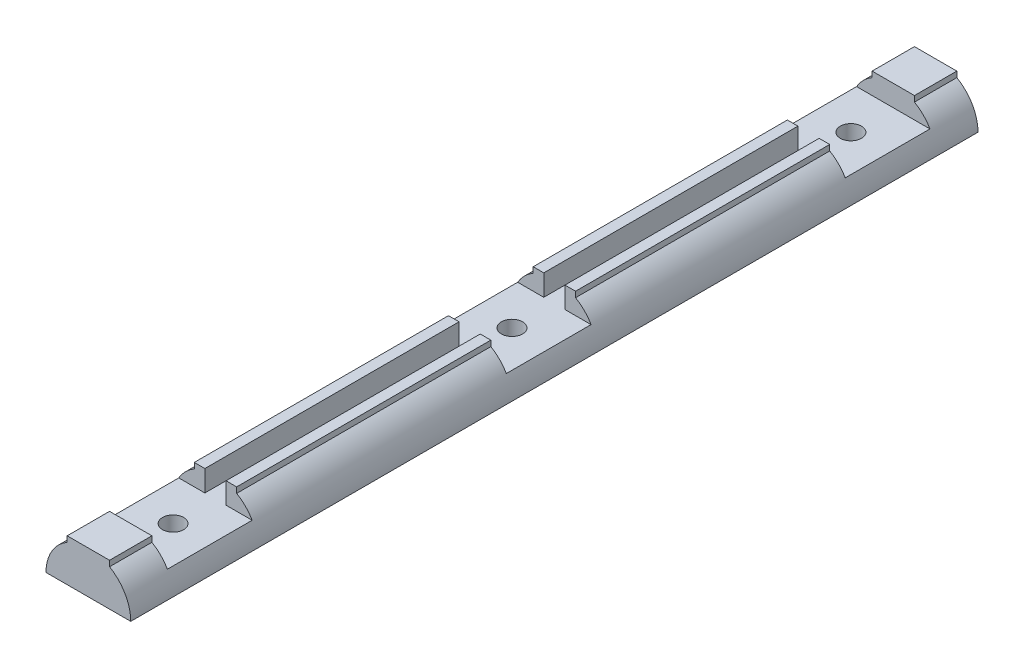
ISO-10303-21;
HEADER;
FILE_DESCRIPTION(('STEP AP214'),'2;1');
FILE_NAME('part.step','',(''),(''),'','','');
FILE_SCHEMA(('AUTOMOTIVE_DESIGN { 1 0 10303 214 1 1 1 1 }'));
ENDSEC;
DATA;
#1=APPLICATION_CONTEXT('core data for automotive mechanical design processes');
#2=APPLICATION_PROTOCOL_DEFINITION('international standard','automotive_design',2000,#1);
#3=PRODUCT_CONTEXT('',#1,'mechanical');
#4=PRODUCT('Part','Part','',(#3));
#5=PRODUCT_RELATED_PRODUCT_CATEGORY('part','',(#4));
#6=PRODUCT_DEFINITION_FORMATION('','',#4);
#7=PRODUCT_DEFINITION_CONTEXT('part definition',#1,'design');
#8=PRODUCT_DEFINITION('design','',#6,#7);
#9=PRODUCT_DEFINITION_SHAPE('','',#8);
#10=(LENGTH_UNIT() NAMED_UNIT(*) SI_UNIT(.MILLI.,.METRE.));
#11=(NAMED_UNIT(*) PLANE_ANGLE_UNIT() SI_UNIT($,.RADIAN.));
#12=(NAMED_UNIT(*) SI_UNIT($,.STERADIAN.) SOLID_ANGLE_UNIT());
#13=UNCERTAINTY_MEASURE_WITH_UNIT(LENGTH_MEASURE(1.E-05),#10,'distance_accuracy_value','');
#14=(GEOMETRIC_REPRESENTATION_CONTEXT(3) GLOBAL_UNCERTAINTY_ASSIGNED_CONTEXT((#13)) GLOBAL_UNIT_ASSIGNED_CONTEXT((#10,
#11,#12)) REPRESENTATION_CONTEXT('',''));
#15=CARTESIAN_POINT('',(0.,0.,0.));
#16=DIRECTION('',(0.,0.,1.));
#17=DIRECTION('',(1.,0.,0.));
#18=AXIS2_PLACEMENT_3D('',#15,#16,#17);
#19=CARTESIAN_POINT('',(0.,0.,100.));
#20=DIRECTION('',(0.,0.,-1.));
#21=DIRECTION('',(-1.,0.,0.));
#22=AXIS2_PLACEMENT_3D('',#19,#20,#21);
#23=CYLINDRICAL_SURFACE('',#22,10.);
#24=CARTESIAN_POINT('',(0.,0.,-100.));
#25=DIRECTION('',(0.,0.,1.));
#26=DIRECTION('',(1.,0.,0.));
#27=AXIS2_PLACEMENT_3D('',#24,#25,#26);
#28=CIRCLE('',#27,10.);
#29=CARTESIAN_POINT('',(-5.,8.66025403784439,-100.));
#30=VERTEX_POINT('',#29);
#31=CARTESIAN_POINT('',(-10.,0.,-100.));
#32=VERTEX_POINT('',#31);
#33=EDGE_CURVE('E263',#30,#32,#28,.T.);
#34=ORIENTED_EDGE('',*,*,#33,.T.);
#35=DIRECTION('',(0.,0.,1.));
#36=VECTOR('',#35,1.);
#37=CARTESIAN_POINT('',(-10.,0.,-100.));
#38=LINE('',#37,#36);
#39=CARTESIAN_POINT('',(-10.,0.,100.));
#40=VERTEX_POINT('',#39);
#41=EDGE_CURVE('E48',#32,#40,#38,.T.);
#42=ORIENTED_EDGE('',*,*,#41,.T.);
#43=CARTESIAN_POINT('',(0.,0.,100.));
#44=DIRECTION('',(0.,0.,1.));
#45=DIRECTION('',(1.,0.,0.));
#46=AXIS2_PLACEMENT_3D('',#43,#44,#45);
#47=CIRCLE('',#46,10.);
#48=CARTESIAN_POINT('',(-5.,8.66025403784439,100.));
#49=VERTEX_POINT('',#48);
#50=EDGE_CURVE('E275',#49,#40,#47,.T.);
#51=ORIENTED_EDGE('',*,*,#50,.F.);
#52=DIRECTION('',(0.,0.,-1.));
#53=VECTOR('',#52,1.);
#54=CARTESIAN_POINT('',(-5.,8.66025403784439,100.));
#55=LINE('',#54,#53);
#56=CARTESIAN_POINT('',(-5.,8.66025403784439,90.));
#57=VERTEX_POINT('',#56);
#58=EDGE_CURVE('E264',#49,#57,#55,.T.);
#59=ORIENTED_EDGE('',*,*,#58,.T.);
#60=CARTESIAN_POINT('',(0.,0.,90.));
#61=DIRECTION('',(0.,0.,1.));
#62=DIRECTION('',(1.,0.,0.));
#63=AXIS2_PLACEMENT_3D('',#60,#61,#62);
#64=CIRCLE('',#63,10.);
#65=CARTESIAN_POINT('',(-8.66025403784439,5.,90.));
#66=VERTEX_POINT('',#65);
#67=EDGE_CURVE('E436',#57,#66,#64,.T.);
#68=ORIENTED_EDGE('',*,*,#67,.T.);
#69=DIRECTION('',(0.,0.,1.));
#70=VECTOR('',#69,1.);
#71=CARTESIAN_POINT('',(-8.66025403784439,5.,70.));
#72=LINE('',#71,#70);
#73=CARTESIAN_POINT('',(-8.66025403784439,5.,70.));
#74=VERTEX_POINT('',#73);
#75=EDGE_CURVE('E424',#74,#66,#72,.T.);
#76=ORIENTED_EDGE('',*,*,#75,.F.);
#77=CARTESIAN_POINT('',(0.,0.,70.));
#78=DIRECTION('',(0.,0.,1.));
#79=DIRECTION('',(1.,0.,0.));
#80=AXIS2_PLACEMENT_3D('',#77,#78,#79);
#81=CIRCLE('',#80,10.);
#82=CARTESIAN_POINT('',(-5.,8.66025403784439,70.));
#83=VERTEX_POINT('',#82);
#84=EDGE_CURVE('E430',#83,#74,#81,.T.);
#85=ORIENTED_EDGE('',*,*,#84,.F.);
#86=CARTESIAN_POINT('',(-5.,8.66025403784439,10.));
#87=VERTEX_POINT('',#86);
#88=EDGE_CURVE('E267',#83,#87,#55,.T.);
#89=ORIENTED_EDGE('',*,*,#88,.T.);
#90=CARTESIAN_POINT('',(0.,0.,9.99999999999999));
#91=DIRECTION('',(0.,0.,1.));
#92=DIRECTION('',(1.,0.,0.));
#93=AXIS2_PLACEMENT_3D('',#90,#91,#92);
#94=CIRCLE('',#93,10.);
#95=CARTESIAN_POINT('',(-8.66025403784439,5.,10.));
#96=VERTEX_POINT('',#95);
#97=EDGE_CURVE('E458',#87,#96,#94,.T.);
#98=ORIENTED_EDGE('',*,*,#97,.T.);
#99=DIRECTION('',(0.,0.,1.));
#100=VECTOR('',#99,1.);
#101=CARTESIAN_POINT('',(-8.66025403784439,5.,-10.));
#102=LINE('',#101,#100);
#103=CARTESIAN_POINT('',(-8.66025403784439,5.,-10.));
#104=VERTEX_POINT('',#103);
#105=EDGE_CURVE('E451',#104,#96,#102,.T.);
#106=ORIENTED_EDGE('',*,*,#105,.F.);
#107=CARTESIAN_POINT('',(0.,0.,-9.99999999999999));
#108=DIRECTION('',(0.,0.,1.));
#109=DIRECTION('',(1.,0.,0.));
#110=AXIS2_PLACEMENT_3D('',#107,#108,#109);
#111=CIRCLE('',#110,10.);
#112=CARTESIAN_POINT('',(-5.,8.66025403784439,-9.99999999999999));
#113=VERTEX_POINT('',#112);
#114=EDGE_CURVE('E311',#113,#104,#111,.T.);
#115=ORIENTED_EDGE('',*,*,#114,.F.);
#116=CARTESIAN_POINT('',(-5.,8.66025403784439,-70.));
#117=VERTEX_POINT('',#116);
#118=EDGE_CURVE('E395',#113,#117,#55,.T.);
#119=ORIENTED_EDGE('',*,*,#118,.T.);
#120=CARTESIAN_POINT('',(0.,0.,-70.));
#121=DIRECTION('',(0.,0.,1.));
#122=DIRECTION('',(1.,0.,0.));
#123=AXIS2_PLACEMENT_3D('',#120,#121,#122);
#124=CIRCLE('',#123,10.);
#125=CARTESIAN_POINT('',(-8.66025403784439,5.,-70.));
#126=VERTEX_POINT('',#125);
#127=EDGE_CURVE('E357',#117,#126,#124,.T.);
#128=ORIENTED_EDGE('',*,*,#127,.T.);
#129=DIRECTION('',(0.,0.,1.));
#130=VECTOR('',#129,1.);
#131=CARTESIAN_POINT('',(-8.66025403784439,5.,-90.));
#132=LINE('',#131,#130);
#133=CARTESIAN_POINT('',(-8.66025403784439,5.,-90.));
#134=VERTEX_POINT('',#133);
#135=EDGE_CURVE('E340',#134,#126,#132,.T.);
#136=ORIENTED_EDGE('',*,*,#135,.F.);
#137=CARTESIAN_POINT('',(0.,0.,-90.));
#138=DIRECTION('',(0.,0.,1.));
#139=DIRECTION('',(1.,0.,0.));
#140=AXIS2_PLACEMENT_3D('',#137,#138,#139);
#141=CIRCLE('',#140,10.);
#142=CARTESIAN_POINT('',(-5.,8.66025403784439,-90.));
#143=VERTEX_POINT('',#142);
#144=EDGE_CURVE('E365',#143,#134,#141,.T.);
#145=ORIENTED_EDGE('',*,*,#144,.F.);
#146=EDGE_CURVE('E269',#143,#30,#55,.T.);
#147=ORIENTED_EDGE('',*,*,#146,.T.);
#148=EDGE_LOOP('',(#34,#42,#51,#59,#68,#76,#85,#89,#98,#106,#115,#119,#128,#136,#145,#147));
#149=FACE_BOUND('',#148,.T.);
#150=ADVANCED_FACE('F33',(#149),#23,.T.);
#151=CARTESIAN_POINT('',(10.,0.,100.));
#152=VERTEX_POINT('',#151);
#153=CARTESIAN_POINT('',(5.,8.66025403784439,100.));
#154=VERTEX_POINT('',#153);
#155=EDGE_CURVE('E257',#152,#154,#47,.T.);
#156=ORIENTED_EDGE('',*,*,#155,.F.);
#157=DIRECTION('',(0.,0.,1.));
#158=VECTOR('',#157,1.);
#159=CARTESIAN_POINT('',(10.,0.,-100.));
#160=LINE('',#159,#158);
#161=CARTESIAN_POINT('',(10.,0.,-100.));
#162=VERTEX_POINT('',#161);
#163=EDGE_CURVE('E242',#162,#152,#160,.T.);
#164=ORIENTED_EDGE('',*,*,#163,.F.);
#165=CARTESIAN_POINT('',(5.,8.66025403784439,-100.));
#166=VERTEX_POINT('',#165);
#167=EDGE_CURVE('E254',#162,#166,#28,.T.);
#168=ORIENTED_EDGE('',*,*,#167,.T.);
#169=DIRECTION('',(0.,0.,-1.));
#170=VECTOR('',#169,1.);
#171=CARTESIAN_POINT('',(5.,8.66025403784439,100.));
#172=LINE('',#171,#170);
#173=CARTESIAN_POINT('',(5.,8.66025403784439,-90.));
#174=VERTEX_POINT('',#173);
#175=EDGE_CURVE('E392',#166,#174,#172,.F.);
#176=ORIENTED_EDGE('',*,*,#175,.T.);
#177=CARTESIAN_POINT('',(0.,0.,-90.));
#178=DIRECTION('',(0.,0.,1.));
#179=DIRECTION('',(1.,0.,0.));
#180=AXIS2_PLACEMENT_3D('',#177,#178,#179);
#181=CIRCLE('',#180,10.);
#182=CARTESIAN_POINT('',(8.66025403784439,5.,-90.));
#183=VERTEX_POINT('',#182);
#184=EDGE_CURVE('E360',#183,#174,#181,.T.);
#185=ORIENTED_EDGE('',*,*,#184,.F.);
#186=DIRECTION('',(0.,0.,1.));
#187=VECTOR('',#186,1.);
#188=CARTESIAN_POINT('',(8.66025403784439,5.,-90.));
#189=LINE('',#188,#187);
#190=CARTESIAN_POINT('',(8.66025403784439,5.,-70.));
#191=VERTEX_POINT('',#190);
#192=EDGE_CURVE('E347',#183,#191,#189,.T.);
#193=ORIENTED_EDGE('',*,*,#192,.T.);
#194=CARTESIAN_POINT('',(0.,0.,-70.));
#195=DIRECTION('',(0.,0.,1.));
#196=DIRECTION('',(1.,0.,0.));
#197=AXIS2_PLACEMENT_3D('',#194,#195,#196);
#198=CIRCLE('',#197,10.);
#199=CARTESIAN_POINT('',(5.,8.66025403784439,-70.));
#200=VERTEX_POINT('',#199);
#201=EDGE_CURVE('E350',#191,#200,#198,.T.);
#202=ORIENTED_EDGE('',*,*,#201,.T.);
#203=CARTESIAN_POINT('',(5.,8.66025403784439,-9.99999999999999));
#204=VERTEX_POINT('',#203);
#205=EDGE_CURVE('E393',#200,#204,#172,.F.);
#206=ORIENTED_EDGE('',*,*,#205,.T.);
#207=CARTESIAN_POINT('',(0.,0.,-9.99999999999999));
#208=DIRECTION('',(0.,0.,1.));
#209=DIRECTION('',(1.,0.,0.));
#210=AXIS2_PLACEMENT_3D('',#207,#208,#209);
#211=CIRCLE('',#210,10.);
#212=CARTESIAN_POINT('',(8.66025403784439,5.,-10.));
#213=VERTEX_POINT('',#212);
#214=EDGE_CURVE('E466',#213,#204,#211,.T.);
#215=ORIENTED_EDGE('',*,*,#214,.F.);
#216=DIRECTION('',(0.,0.,1.));
#217=VECTOR('',#216,1.);
#218=CARTESIAN_POINT('',(8.66025403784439,5.,-10.));
#219=LINE('',#218,#217);
#220=CARTESIAN_POINT('',(8.66025403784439,5.,10.));
#221=VERTEX_POINT('',#220);
#222=EDGE_CURVE('E448',#213,#221,#219,.T.);
#223=ORIENTED_EDGE('',*,*,#222,.T.);
#224=CARTESIAN_POINT('',(0.,0.,9.99999999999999));
#225=DIRECTION('',(0.,0.,1.));
#226=DIRECTION('',(1.,0.,0.));
#227=AXIS2_PLACEMENT_3D('',#224,#225,#226);
#228=CIRCLE('',#227,10.);
#229=CARTESIAN_POINT('',(5.,8.66025403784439,10.));
#230=VERTEX_POINT('',#229);
#231=EDGE_CURVE('E408',#221,#230,#228,.T.);
#232=ORIENTED_EDGE('',*,*,#231,.T.);
#233=CARTESIAN_POINT('',(5.,8.66025403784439,70.));
#234=VERTEX_POINT('',#233);
#235=EDGE_CURVE('E397',#230,#234,#172,.F.);
#236=ORIENTED_EDGE('',*,*,#235,.T.);
#237=CARTESIAN_POINT('',(0.,0.,70.));
#238=DIRECTION('',(0.,0.,1.));
#239=DIRECTION('',(1.,0.,0.));
#240=AXIS2_PLACEMENT_3D('',#237,#238,#239);
#241=CIRCLE('',#240,10.);
#242=CARTESIAN_POINT('',(8.66025403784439,5.,70.));
#243=VERTEX_POINT('',#242);
#244=EDGE_CURVE('E406',#243,#234,#241,.T.);
#245=ORIENTED_EDGE('',*,*,#244,.F.);
#246=DIRECTION('',(0.,0.,1.));
#247=VECTOR('',#246,1.);
#248=CARTESIAN_POINT('',(8.66025403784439,5.,70.));
#249=LINE('',#248,#247);
#250=CARTESIAN_POINT('',(8.66025403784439,5.,90.));
#251=VERTEX_POINT('',#250);
#252=EDGE_CURVE('E420',#243,#251,#249,.T.);
#253=ORIENTED_EDGE('',*,*,#252,.T.);
#254=CARTESIAN_POINT('',(0.,0.,90.));
#255=DIRECTION('',(0.,0.,1.));
#256=DIRECTION('',(1.,0.,0.));
#257=AXIS2_PLACEMENT_3D('',#254,#255,#256);
#258=CIRCLE('',#257,10.);
#259=CARTESIAN_POINT('',(5.,8.66025403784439,90.));
#260=VERTEX_POINT('',#259);
#261=EDGE_CURVE('E432',#251,#260,#258,.T.);
#262=ORIENTED_EDGE('',*,*,#261,.T.);
#263=EDGE_CURVE('E375',#260,#154,#172,.F.);
#264=ORIENTED_EDGE('',*,*,#263,.T.);
#265=EDGE_LOOP('',(#156,#164,#168,#176,#185,#193,#202,#206,#215,#223,#232,#236,#245,#253,#262,#264));
#266=FACE_BOUND('',#265,.T.);
#267=ADVANCED_FACE('F252',(#266),#23,.T.);
#268=CARTESIAN_POINT('',(-5.,-10.,-122.360679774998));
#269=DIRECTION('',(-1.,0.,0.));
#270=DIRECTION('',(0.,0.,1.));
#271=AXIS2_PLACEMENT_3D('',#268,#269,#270);
#272=PLANE('',#271);
#273=ORIENTED_EDGE('',*,*,#88,.F.);
#274=DIRECTION('',(0.,1.,0.));
#275=VECTOR('',#274,1.);
#276=CARTESIAN_POINT('',(-5.,-10.,70.));
#277=LINE('',#276,#275);
#278=CARTESIAN_POINT('',(-5.,10.,70.));
#279=VERTEX_POINT('',#278);
#280=EDGE_CURVE('E422',#83,#279,#277,.T.);
#281=ORIENTED_EDGE('',*,*,#280,.T.);
#282=DIRECTION('',(0.,0.,1.));
#283=VECTOR('',#282,1.);
#284=CARTESIAN_POINT('',(-5.,10.,-122.360679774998));
#285=LINE('',#284,#283);
#286=CARTESIAN_POINT('',(-5.,10.,10.));
#287=VERTEX_POINT('',#286);
#288=EDGE_CURVE('E487',#287,#279,#285,.T.);
#289=ORIENTED_EDGE('',*,*,#288,.F.);
#290=DIRECTION('',(0.,1.,0.));
#291=VECTOR('',#290,1.);
#292=CARTESIAN_POINT('',(-5.,-10.,10.));
#293=LINE('',#292,#291);
#294=EDGE_CURVE('E456',#87,#287,#293,.T.);
#295=ORIENTED_EDGE('',*,*,#294,.F.);
#296=EDGE_LOOP('',(#273,#281,#289,#295));
#297=FACE_BOUND('',#296,.T.);
#298=ADVANCED_FACE('F485',(#297),#272,.T.);
#299=CARTESIAN_POINT('',(5.,10.,-122.360679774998));
#300=DIRECTION('',(0.,1.,0.));
#301=DIRECTION('',(0.,0.,1.));
#302=AXIS2_PLACEMENT_3D('',#299,#300,#301);
#303=PLANE('',#302);
#304=ORIENTED_EDGE('',*,*,#288,.T.);
#305=DIRECTION('',(-1.,0.,0.));
#306=VECTOR('',#305,1.);
#307=CARTESIAN_POINT('',(8.66025403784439,10.,70.));
#308=LINE('',#307,#306);
#309=CARTESIAN_POINT('',(-2.5,10.,70.));
#310=VERTEX_POINT('',#309);
#311=EDGE_CURVE('E524',#310,#279,#308,.T.);
#312=ORIENTED_EDGE('',*,*,#311,.F.);
#313=DIRECTION('',(0.,0.,1.));
#314=VECTOR('',#313,1.);
#315=CARTESIAN_POINT('',(-2.5,10.,70.));
#316=LINE('',#315,#314);
#317=CARTESIAN_POINT('',(-2.5,10.,10.));
#318=VERTEX_POINT('',#317);
#319=EDGE_CURVE('E306',#318,#310,#316,.T.);
#320=ORIENTED_EDGE('',*,*,#319,.F.);
#321=DIRECTION('',(-1.,0.,0.));
#322=VECTOR('',#321,1.);
#323=CARTESIAN_POINT('',(8.66025403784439,10.,10.));
#324=LINE('',#323,#322);
#325=EDGE_CURVE('E444',#318,#287,#324,.T.);
#326=ORIENTED_EDGE('',*,*,#325,.T.);
#327=EDGE_LOOP('',(#304,#312,#320,#326));
#328=FACE_BOUND('',#327,.T.);
#329=ADVANCED_FACE('F596',(#328),#303,.T.);
#330=DIRECTION('',(0.,0.,-1.));
#331=VECTOR('',#330,1.);
#332=CARTESIAN_POINT('',(2.5,10.,70.));
#333=LINE('',#332,#331);
#334=CARTESIAN_POINT('',(2.5,10.,70.));
#335=VERTEX_POINT('',#334);
#336=CARTESIAN_POINT('',(2.5,10.,10.));
#337=VERTEX_POINT('',#336);
#338=EDGE_CURVE('E308',#335,#337,#333,.T.);
#339=ORIENTED_EDGE('',*,*,#338,.F.);
#340=CARTESIAN_POINT('',(5.,10.,70.));
#341=VERTEX_POINT('',#340);
#342=EDGE_CURVE('E527',#341,#335,#308,.T.);
#343=ORIENTED_EDGE('',*,*,#342,.F.);
#344=DIRECTION('',(0.,0.,1.));
#345=VECTOR('',#344,1.);
#346=CARTESIAN_POINT('',(5.,10.,-122.360679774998));
#347=LINE('',#346,#345);
#348=CARTESIAN_POINT('',(5.,10.,10.));
#349=VERTEX_POINT('',#348);
#350=EDGE_CURVE('E417',#349,#341,#347,.T.);
#351=ORIENTED_EDGE('',*,*,#350,.F.);
#352=EDGE_CURVE('E447',#349,#337,#324,.T.);
#353=ORIENTED_EDGE('',*,*,#352,.T.);
#354=EDGE_LOOP('',(#339,#343,#351,#353));
#355=FACE_BOUND('',#354,.T.);
#356=ADVANCED_FACE('F565',(#355),#303,.T.);
#357=CARTESIAN_POINT('',(5.,-10.,-122.360679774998));
#358=DIRECTION('',(1.,0.,0.));
#359=DIRECTION('',(0.,0.,-1.));
#360=AXIS2_PLACEMENT_3D('',#357,#358,#359);
#361=PLANE('',#360);
#362=ORIENTED_EDGE('',*,*,#350,.T.);
#363=DIRECTION('',(0.,-1.,0.));
#364=VECTOR('',#363,1.);
#365=CARTESIAN_POINT('',(5.,-10.,70.));
#366=LINE('',#365,#364);
#367=EDGE_CURVE('E416',#341,#234,#366,.T.);
#368=ORIENTED_EDGE('',*,*,#367,.T.);
#369=ORIENTED_EDGE('',*,*,#235,.F.);
#370=DIRECTION('',(0.,-1.,0.));
#371=VECTOR('',#370,1.);
#372=CARTESIAN_POINT('',(5.,-10.,10.));
#373=LINE('',#372,#371);
#374=EDGE_CURVE('E414',#349,#230,#373,.T.);
#375=ORIENTED_EDGE('',*,*,#374,.F.);
#376=EDGE_LOOP('',(#362,#368,#369,#375));
#377=FACE_BOUND('',#376,.T.);
#378=ADVANCED_FACE('F413',(#377),#361,.T.);
#379=ORIENTED_EDGE('',*,*,#118,.F.);
#380=DIRECTION('',(0.,1.,0.));
#381=VECTOR('',#380,1.);
#382=CARTESIAN_POINT('',(-5.,-10.,-9.99999999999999));
#383=LINE('',#382,#381);
#384=CARTESIAN_POINT('',(-5.,10.,-10.));
#385=VERTEX_POINT('',#384);
#386=EDGE_CURVE('E468',#113,#385,#383,.T.);
#387=ORIENTED_EDGE('',*,*,#386,.T.);
#388=CARTESIAN_POINT('',(-5.,10.,-70.));
#389=VERTEX_POINT('',#388);
#390=EDGE_CURVE('E299',#389,#385,#285,.T.);
#391=ORIENTED_EDGE('',*,*,#390,.F.);
#392=DIRECTION('',(0.,1.,0.));
#393=VECTOR('',#392,1.);
#394=CARTESIAN_POINT('',(-5.,-10.,-70.));
#395=LINE('',#394,#393);
#396=EDGE_CURVE('E354',#117,#389,#395,.T.);
#397=ORIENTED_EDGE('',*,*,#396,.F.);
#398=EDGE_LOOP('',(#379,#387,#391,#397));
#399=FACE_BOUND('',#398,.T.);
#400=ADVANCED_FACE('F581',(#399),#272,.T.);
#401=ORIENTED_EDGE('',*,*,#390,.T.);
#402=DIRECTION('',(-1.,0.,0.));
#403=VECTOR('',#402,1.);
#404=CARTESIAN_POINT('',(8.66025403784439,10.,-10.));
#405=LINE('',#404,#403);
#406=CARTESIAN_POINT('',(-2.5,10.,-10.));
#407=VERTEX_POINT('',#406);
#408=EDGE_CURVE('E285',#407,#385,#405,.T.);
#409=ORIENTED_EDGE('',*,*,#408,.F.);
#410=CARTESIAN_POINT('',(-2.5,10.,-70.));
#411=VERTEX_POINT('',#410);
#412=EDGE_CURVE('E296',#411,#407,#316,.T.);
#413=ORIENTED_EDGE('',*,*,#412,.F.);
#414=DIRECTION('',(-1.,0.,0.));
#415=VECTOR('',#414,1.);
#416=CARTESIAN_POINT('',(8.66025403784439,10.,-70.));
#417=LINE('',#416,#415);
#418=EDGE_CURVE('E344',#411,#389,#417,.T.);
#419=ORIENTED_EDGE('',*,*,#418,.T.);
#420=EDGE_LOOP('',(#401,#409,#413,#419));
#421=FACE_BOUND('',#420,.T.);
#422=ADVANCED_FACE('F295',(#421),#303,.T.);
#423=CARTESIAN_POINT('',(2.5,10.,-10.));
#424=VERTEX_POINT('',#423);
#425=CARTESIAN_POINT('',(2.5,10.,-70.));
#426=VERTEX_POINT('',#425);
#427=EDGE_CURVE('E305',#424,#426,#333,.T.);
#428=ORIENTED_EDGE('',*,*,#427,.F.);
#429=CARTESIAN_POINT('',(5.,10.,-10.));
#430=VERTEX_POINT('',#429);
#431=EDGE_CURVE('E300',#430,#424,#405,.T.);
#432=ORIENTED_EDGE('',*,*,#431,.F.);
#433=CARTESIAN_POINT('',(5.,10.,-70.));
#434=VERTEX_POINT('',#433);
#435=EDGE_CURVE('E391',#434,#430,#347,.T.);
#436=ORIENTED_EDGE('',*,*,#435,.F.);
#437=EDGE_CURVE('E338',#434,#426,#417,.T.);
#438=ORIENTED_EDGE('',*,*,#437,.T.);
#439=EDGE_LOOP('',(#428,#432,#436,#438));
#440=FACE_BOUND('',#439,.T.);
#441=ADVANCED_FACE('F548',(#440),#303,.T.);
#442=ORIENTED_EDGE('',*,*,#435,.T.);
#443=DIRECTION('',(0.,-1.,0.));
#444=VECTOR('',#443,1.);
#445=CARTESIAN_POINT('',(5.,-10.,-9.99999999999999));
#446=LINE('',#445,#444);
#447=EDGE_CURVE('E463',#430,#204,#446,.T.);
#448=ORIENTED_EDGE('',*,*,#447,.T.);
#449=ORIENTED_EDGE('',*,*,#205,.F.);
#450=DIRECTION('',(0.,-1.,0.));
#451=VECTOR('',#450,1.);
#452=CARTESIAN_POINT('',(5.,-10.,-70.));
#453=LINE('',#452,#451);
#454=EDGE_CURVE('E272',#434,#200,#453,.T.);
#455=ORIENTED_EDGE('',*,*,#454,.F.);
#456=EDGE_LOOP('',(#442,#448,#449,#455));
#457=FACE_BOUND('',#456,.T.);
#458=ADVANCED_FACE('F543',(#457),#361,.T.);
#459=CARTESIAN_POINT('',(2.5,-135.089257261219,70.));
#460=DIRECTION('',(1.,0.,0.));
#461=DIRECTION('',(0.,0.,-1.));
#462=AXIS2_PLACEMENT_3D('',#459,#460,#461);
#463=PLANE('',#462);
#464=DIRECTION('',(0.,-1.,0.));
#465=VECTOR('',#464,1.);
#466=CARTESIAN_POINT('',(2.5,-135.089257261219,-9.99999999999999));
#467=LINE('',#466,#465);
#468=CARTESIAN_POINT('',(2.5,5.,-10.));
#469=VERTEX_POINT('',#468);
#470=EDGE_CURVE('E461',#424,#469,#467,.T.);
#471=ORIENTED_EDGE('',*,*,#470,.F.);
#472=ORIENTED_EDGE('',*,*,#427,.T.);
#473=DIRECTION('',(0.,1.,0.));
#474=VECTOR('',#473,1.);
#475=CARTESIAN_POINT('',(2.5,-135.089257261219,-70.));
#476=LINE('',#475,#474);
#477=CARTESIAN_POINT('',(2.5,5.,-70.));
#478=VERTEX_POINT('',#477);
#479=EDGE_CURVE('E321',#478,#426,#476,.T.);
#480=ORIENTED_EDGE('',*,*,#479,.F.);
#481=DIRECTION('',(0.,0.,-1.));
#482=VECTOR('',#481,1.);
#483=CARTESIAN_POINT('',(2.5,5.,70.));
#484=LINE('',#483,#482);
#485=EDGE_CURVE('E322',#469,#478,#484,.T.);
#486=ORIENTED_EDGE('',*,*,#485,.F.);
#487=EDGE_LOOP('',(#471,#472,#480,#486));
#488=FACE_BOUND('',#487,.T.);
#489=ADVANCED_FACE('F555',(#488),#463,.F.);
#490=CARTESIAN_POINT('',(-2.5,-135.089257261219,70.));
#491=DIRECTION('',(-1.,0.,0.));
#492=DIRECTION('',(0.,0.,1.));
#493=AXIS2_PLACEMENT_3D('',#490,#491,#492);
#494=PLANE('',#493);
#495=DIRECTION('',(0.,1.,0.));
#496=VECTOR('',#495,1.);
#497=CARTESIAN_POINT('',(-2.5,-135.089257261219,-9.99999999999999));
#498=LINE('',#497,#496);
#499=CARTESIAN_POINT('',(-2.5,5.,-10.));
#500=VERTEX_POINT('',#499);
#501=EDGE_CURVE('E41',#500,#407,#498,.T.);
#502=ORIENTED_EDGE('',*,*,#501,.F.);
#503=DIRECTION('',(0.,0.,1.));
#504=VECTOR('',#503,1.);
#505=CARTESIAN_POINT('',(-2.5,5.,70.));
#506=LINE('',#505,#504);
#507=CARTESIAN_POINT('',(-2.5,5.,-70.));
#508=VERTEX_POINT('',#507);
#509=EDGE_CURVE('E314',#508,#500,#506,.T.);
#510=ORIENTED_EDGE('',*,*,#509,.F.);
#511=DIRECTION('',(0.,1.,0.));
#512=VECTOR('',#511,1.);
#513=CARTESIAN_POINT('',(-2.5,-135.089257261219,-70.));
#514=LINE('',#513,#512);
#515=EDGE_CURVE('E304',#508,#411,#514,.T.);
#516=ORIENTED_EDGE('',*,*,#515,.T.);
#517=ORIENTED_EDGE('',*,*,#412,.T.);
#518=EDGE_LOOP('',(#502,#510,#516,#517));
#519=FACE_BOUND('',#518,.T.);
#520=ADVANCED_FACE('F302',(#519),#494,.F.);
#521=CARTESIAN_POINT('',(0.,0.,-70.));
#522=DIRECTION('',(0.,0.,1.));
#523=DIRECTION('',(1.,0.,0.));
#524=AXIS2_PLACEMENT_3D('',#521,#522,#523);
#525=PLANE('',#524);
#526=DIRECTION('',(1.,0.,0.));
#527=VECTOR('',#526,1.);
#528=CARTESIAN_POINT('',(8.66025403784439,5.,-70.));
#529=LINE('',#528,#527);
#530=EDGE_CURVE('E333',#478,#191,#529,.T.);
#531=ORIENTED_EDGE('',*,*,#530,.F.);
#532=ORIENTED_EDGE('',*,*,#479,.T.);
#533=ORIENTED_EDGE('',*,*,#437,.F.);
#534=ORIENTED_EDGE('',*,*,#454,.T.);
#535=ORIENTED_EDGE('',*,*,#201,.F.);
#536=EDGE_LOOP('',(#531,#532,#533,#534,#535));
#537=FACE_BOUND('',#536,.T.);
#538=ADVANCED_FACE('F569',(#537),#525,.F.);
#539=ORIENTED_EDGE('',*,*,#146,.F.);
#540=DIRECTION('',(0.,1.,0.));
#541=VECTOR('',#540,1.);
#542=CARTESIAN_POINT('',(-5.,-10.,-90.));
#543=LINE('',#542,#541);
#544=CARTESIAN_POINT('',(-5.,10.,-90.));
#545=VERTEX_POINT('',#544);
#546=EDGE_CURVE('E362',#143,#545,#543,.T.);
#547=ORIENTED_EDGE('',*,*,#546,.T.);
#548=CARTESIAN_POINT('',(-5.,10.,-100.));
#549=VERTEX_POINT('',#548);
#550=EDGE_CURVE('E370',#549,#545,#285,.T.);
#551=ORIENTED_EDGE('',*,*,#550,.F.);
#552=DIRECTION('',(0.,1.,0.));
#553=VECTOR('',#552,1.);
#554=CARTESIAN_POINT('',(-5.,-10.,-100.));
#555=LINE('',#554,#553);
#556=EDGE_CURVE('E372',#30,#549,#555,.T.);
#557=ORIENTED_EDGE('',*,*,#556,.F.);
#558=EDGE_LOOP('',(#539,#547,#551,#557));
#559=FACE_BOUND('',#558,.T.);
#560=ADVANCED_FACE('F571',(#559),#272,.T.);
#561=ORIENTED_EDGE('',*,*,#550,.T.);
#562=DIRECTION('',(-1.,0.,0.));
#563=VECTOR('',#562,1.);
#564=CARTESIAN_POINT('',(8.66025403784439,10.,-90.));
#565=LINE('',#564,#563);
#566=CARTESIAN_POINT('',(5.,10.,-90.));
#567=VERTEX_POINT('',#566);
#568=EDGE_CURVE('E337',#567,#545,#565,.T.);
#569=ORIENTED_EDGE('',*,*,#568,.F.);
#570=CARTESIAN_POINT('',(5.,10.,-100.));
#571=VERTEX_POINT('',#570);
#572=EDGE_CURVE('E388',#571,#567,#347,.T.);
#573=ORIENTED_EDGE('',*,*,#572,.F.);
#574=DIRECTION('',(1.,0.,0.));
#575=VECTOR('',#574,1.);
#576=CARTESIAN_POINT('',(5.,10.,-100.));
#577=LINE('',#576,#575);
#578=EDGE_CURVE('E369',#549,#571,#577,.T.);
#579=ORIENTED_EDGE('',*,*,#578,.F.);
#580=EDGE_LOOP('',(#561,#569,#573,#579));
#581=FACE_BOUND('',#580,.T.);
#582=ADVANCED_FACE('F578',(#581),#303,.T.);
#583=ORIENTED_EDGE('',*,*,#572,.T.);
#584=DIRECTION('',(0.,-1.,0.));
#585=VECTOR('',#584,1.);
#586=CARTESIAN_POINT('',(5.,-10.,-90.));
#587=LINE('',#586,#585);
#588=EDGE_CURVE('E274',#567,#174,#587,.T.);
#589=ORIENTED_EDGE('',*,*,#588,.T.);
#590=ORIENTED_EDGE('',*,*,#175,.F.);
#591=DIRECTION('',(0.,-1.,0.));
#592=VECTOR('',#591,1.);
#593=CARTESIAN_POINT('',(5.,-10.,-100.));
#594=LINE('',#593,#592);
#595=EDGE_CURVE('E262',#571,#166,#594,.T.);
#596=ORIENTED_EDGE('',*,*,#595,.F.);
#597=EDGE_LOOP('',(#583,#589,#590,#596));
#598=FACE_BOUND('',#597,.T.);
#599=ADVANCED_FACE('F613',(#598),#361,.T.);
#600=CARTESIAN_POINT('',(0.,0.,100.));
#601=DIRECTION('',(0.,0.,1.));
#602=DIRECTION('',(1.,0.,0.));
#603=AXIS2_PLACEMENT_3D('',#600,#601,#602);
#604=PLANE('',#603);
#605=DIRECTION('',(-1.,0.,0.));
#606=VECTOR('',#605,1.);
#607=CARTESIAN_POINT('',(10.,0.,100.));
#608=LINE('',#607,#606);
#609=EDGE_CURVE('E248',#152,#40,#608,.T.);
#610=ORIENTED_EDGE('',*,*,#609,.F.);
#611=ORIENTED_EDGE('',*,*,#155,.T.);
#612=DIRECTION('',(0.,1.,0.));
#613=VECTOR('',#612,1.);
#614=CARTESIAN_POINT('',(5.,-10.,100.));
#615=LINE('',#614,#613);
#616=CARTESIAN_POINT('',(5.,10.,100.));
#617=VERTEX_POINT('',#616);
#618=EDGE_CURVE('E378',#154,#617,#615,.T.);
#619=ORIENTED_EDGE('',*,*,#618,.T.);
#620=DIRECTION('',(-1.,0.,0.));
#621=VECTOR('',#620,1.);
#622=CARTESIAN_POINT('',(5.,10.,100.));
#623=LINE('',#622,#621);
#624=CARTESIAN_POINT('',(-5.,10.,100.));
#625=VERTEX_POINT('',#624);
#626=EDGE_CURVE('E381',#617,#625,#623,.T.);
#627=ORIENTED_EDGE('',*,*,#626,.T.);
#628=DIRECTION('',(0.,-1.,0.));
#629=VECTOR('',#628,1.);
#630=CARTESIAN_POINT('',(-5.,-10.,100.));
#631=LINE('',#630,#629);
#632=EDGE_CURVE('E367',#625,#49,#631,.T.);
#633=ORIENTED_EDGE('',*,*,#632,.T.);
#634=ORIENTED_EDGE('',*,*,#50,.T.);
#635=EDGE_LOOP('',(#610,#611,#619,#627,#633,#634));
#636=FACE_BOUND('',#635,.T.);
#637=ADVANCED_FACE('F501',(#636),#604,.T.);
#638=CARTESIAN_POINT('',(0.,0.,-100.));
#639=DIRECTION('',(0.,0.,1.));
#640=DIRECTION('',(1.,0.,0.));
#641=AXIS2_PLACEMENT_3D('',#638,#639,#640);
#642=PLANE('',#641);
#643=ORIENTED_EDGE('',*,*,#167,.F.);
#644=DIRECTION('',(-1.,0.,0.));
#645=VECTOR('',#644,1.);
#646=CARTESIAN_POINT('',(10.,0.,-100.));
#647=LINE('',#646,#645);
#648=EDGE_CURVE('E238',#162,#32,#647,.T.);
#649=ORIENTED_EDGE('',*,*,#648,.T.);
#650=ORIENTED_EDGE('',*,*,#33,.F.);
#651=ORIENTED_EDGE('',*,*,#556,.T.);
#652=ORIENTED_EDGE('',*,*,#578,.T.);
#653=ORIENTED_EDGE('',*,*,#595,.T.);
#654=EDGE_LOOP('',(#643,#649,#650,#651,#652,#653));
#655=FACE_BOUND('',#654,.T.);
#656=ADVANCED_FACE('F260',(#655),#642,.F.);
#657=DIRECTION('',(0.,1.,0.));
#658=VECTOR('',#657,1.);
#659=CARTESIAN_POINT('',(-5.,-10.,90.));
#660=LINE('',#659,#658);
#661=CARTESIAN_POINT('',(-5.,10.,90.));
#662=VERTEX_POINT('',#661);
#663=EDGE_CURVE('E434',#57,#662,#660,.T.);
#664=ORIENTED_EDGE('',*,*,#663,.F.);
#665=ORIENTED_EDGE('',*,*,#58,.F.);
#666=ORIENTED_EDGE('',*,*,#632,.F.);
#667=EDGE_CURVE('E387',#662,#625,#285,.T.);
#668=ORIENTED_EDGE('',*,*,#667,.F.);
#669=EDGE_LOOP('',(#664,#665,#666,#668));
#670=FACE_BOUND('',#669,.T.);
#671=ADVANCED_FACE('F504',(#670),#272,.T.);
#672=DIRECTION('',(-1.,0.,0.));
#673=VECTOR('',#672,1.);
#674=CARTESIAN_POINT('',(8.66025403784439,10.,90.));
#675=LINE('',#674,#673);
#676=CARTESIAN_POINT('',(5.,10.,90.));
#677=VERTEX_POINT('',#676);
#678=EDGE_CURVE('E496',#677,#662,#675,.T.);
#679=ORIENTED_EDGE('',*,*,#678,.T.);
#680=ORIENTED_EDGE('',*,*,#667,.T.);
#681=ORIENTED_EDGE('',*,*,#626,.F.);
#682=EDGE_CURVE('E384',#677,#617,#347,.T.);
#683=ORIENTED_EDGE('',*,*,#682,.F.);
#684=EDGE_LOOP('',(#679,#680,#681,#683));
#685=FACE_BOUND('',#684,.T.);
#686=ADVANCED_FACE('F494',(#685),#303,.T.);
#687=DIRECTION('',(0.,-1.,0.));
#688=VECTOR('',#687,1.);
#689=CARTESIAN_POINT('',(5.,-10.,90.));
#690=LINE('',#689,#688);
#691=EDGE_CURVE('E12',#677,#260,#690,.T.);
#692=ORIENTED_EDGE('',*,*,#691,.F.);
#693=ORIENTED_EDGE('',*,*,#682,.T.);
#694=ORIENTED_EDGE('',*,*,#618,.F.);
#695=ORIENTED_EDGE('',*,*,#263,.F.);
#696=EDGE_LOOP('',(#692,#693,#694,#695));
#697=FACE_BOUND('',#696,.T.);
#698=ADVANCED_FACE('F538',(#697),#361,.T.);
#699=CARTESIAN_POINT('',(0.,0.,-90.));
#700=DIRECTION('',(0.,0.,1.));
#701=DIRECTION('',(1.,0.,0.));
#702=AXIS2_PLACEMENT_3D('',#699,#700,#701);
#703=PLANE('',#702);
#704=ORIENTED_EDGE('',*,*,#144,.T.);
#705=DIRECTION('',(1.,0.,0.));
#706=VECTOR('',#705,1.);
#707=CARTESIAN_POINT('',(8.66025403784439,5.,-90.));
#708=LINE('',#707,#706);
#709=EDGE_CURVE('E334',#134,#183,#708,.T.);
#710=ORIENTED_EDGE('',*,*,#709,.T.);
#711=ORIENTED_EDGE('',*,*,#184,.T.);
#712=ORIENTED_EDGE('',*,*,#588,.F.);
#713=ORIENTED_EDGE('',*,*,#568,.T.);
#714=ORIENTED_EDGE('',*,*,#546,.F.);
#715=EDGE_LOOP('',(#704,#710,#711,#712,#713,#714));
#716=FACE_BOUND('',#715,.T.);
#717=ADVANCED_FACE('F587',(#716),#703,.T.);
#718=ORIENTED_EDGE('',*,*,#418,.F.);
#719=ORIENTED_EDGE('',*,*,#515,.F.);
#720=EDGE_CURVE('E341',#126,#508,#529,.T.);
#721=ORIENTED_EDGE('',*,*,#720,.F.);
#722=ORIENTED_EDGE('',*,*,#127,.F.);
#723=ORIENTED_EDGE('',*,*,#396,.T.);
#724=EDGE_LOOP('',(#718,#719,#721,#722,#723));
#725=FACE_BOUND('',#724,.T.);
#726=ADVANCED_FACE('F573',(#725),#525,.F.);
#727=CARTESIAN_POINT('',(8.66025403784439,5.,-90.));
#728=DIRECTION('',(0.,-1.,0.));
#729=DIRECTION('',(0.,0.,-1.));
#730=AXIS2_PLACEMENT_3D('',#727,#728,#729);
#731=PLANE('',#730);
#732=CARTESIAN_POINT('',(0.,4.99999999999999,80.));
#733=DIRECTION('',(0.,1.,0.));
#734=DIRECTION('',(0.,0.,1.));
#735=AXIS2_PLACEMENT_3D('',#732,#733,#734);
#736=CIRCLE('',#735,2.5);
#737=CARTESIAN_POINT('',(0.,4.99999999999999,82.5));
#738=VERTEX_POINT('',#737);
#739=EDGE_CURVE('E515',#738,#738,#736,.T.);
#740=ORIENTED_EDGE('',*,*,#739,.F.);
#741=EDGE_LOOP('',(#740));
#742=FACE_BOUND('',#741,.T.);
#743=CARTESIAN_POINT('',(0.,5.,0.));
#744=DIRECTION('',(0.,1.,0.));
#745=DIRECTION('',(0.,0.,1.));
#746=AXIS2_PLACEMENT_3D('',#743,#744,#745);
#747=CIRCLE('',#746,2.5);
#748=CARTESIAN_POINT('',(0.,5.,2.49999999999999));
#749=VERTEX_POINT('',#748);
#750=EDGE_CURVE('E518',#749,#749,#747,.T.);
#751=ORIENTED_EDGE('',*,*,#750,.F.);
#752=EDGE_LOOP('',(#751));
#753=FACE_BOUND('',#752,.T.);
#754=CARTESIAN_POINT('',(2.5,5.,70.));
#755=VERTEX_POINT('',#754);
#756=CARTESIAN_POINT('',(2.5,5.,10.));
#757=VERTEX_POINT('',#756);
#758=EDGE_CURVE('E318',#755,#757,#484,.T.);
#759=ORIENTED_EDGE('',*,*,#758,.T.);
#760=DIRECTION('',(1.,0.,0.));
#761=VECTOR('',#760,1.);
#762=CARTESIAN_POINT('',(8.66025403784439,5.,10.));
#763=LINE('',#762,#761);
#764=EDGE_CURVE('E56',#757,#221,#763,.T.);
#765=ORIENTED_EDGE('',*,*,#764,.T.);
#766=ORIENTED_EDGE('',*,*,#222,.F.);
#767=DIRECTION('',(1.,0.,0.));
#768=VECTOR('',#767,1.);
#769=CARTESIAN_POINT('',(8.66025403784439,5.,-10.));
#770=LINE('',#769,#768);
#771=EDGE_CURVE('E439',#469,#213,#770,.T.);
#772=ORIENTED_EDGE('',*,*,#771,.F.);
#773=ORIENTED_EDGE('',*,*,#485,.T.);
#774=ORIENTED_EDGE('',*,*,#530,.T.);
#775=ORIENTED_EDGE('',*,*,#192,.F.);
#776=ORIENTED_EDGE('',*,*,#709,.F.);
#777=ORIENTED_EDGE('',*,*,#135,.T.);
#778=ORIENTED_EDGE('',*,*,#720,.T.);
#779=ORIENTED_EDGE('',*,*,#509,.T.);
#780=EDGE_CURVE('E288',#104,#500,#770,.T.);
#781=ORIENTED_EDGE('',*,*,#780,.F.);
#782=ORIENTED_EDGE('',*,*,#105,.T.);
#783=CARTESIAN_POINT('',(-2.5,5.,10.));
#784=VERTEX_POINT('',#783);
#785=EDGE_CURVE('E441',#96,#784,#763,.T.);
#786=ORIENTED_EDGE('',*,*,#785,.T.);
#787=CARTESIAN_POINT('',(-2.5,5.,70.));
#788=VERTEX_POINT('',#787);
#789=EDGE_CURVE('E317',#784,#788,#506,.T.);
#790=ORIENTED_EDGE('',*,*,#789,.T.);
#791=DIRECTION('',(1.,0.,0.));
#792=VECTOR('',#791,1.);
#793=CARTESIAN_POINT('',(8.66025403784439,5.,70.));
#794=LINE('',#793,#792);
#795=EDGE_CURVE('E522',#74,#788,#794,.T.);
#796=ORIENTED_EDGE('',*,*,#795,.F.);
#797=ORIENTED_EDGE('',*,*,#75,.T.);
#798=DIRECTION('',(1.,0.,0.));
#799=VECTOR('',#798,1.);
#800=CARTESIAN_POINT('',(8.66025403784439,5.,90.));
#801=LINE('',#800,#799);
#802=EDGE_CURVE('E521',#66,#251,#801,.T.);
#803=ORIENTED_EDGE('',*,*,#802,.T.);
#804=ORIENTED_EDGE('',*,*,#252,.F.);
#805=EDGE_CURVE('E525',#755,#243,#794,.T.);
#806=ORIENTED_EDGE('',*,*,#805,.F.);
#807=EDGE_LOOP('',(#759,#765,#766,#772,#773,#774,#775,#776,#777,#778,#779,#781,#782,#786,#790,
#796,#797,#803,#804,#806));
#808=FACE_BOUND('',#807,.T.);
#809=CARTESIAN_POINT('',(0.,5.,-80.));
#810=DIRECTION('',(0.,1.,0.));
#811=DIRECTION('',(0.,0.,1.));
#812=AXIS2_PLACEMENT_3D('',#809,#810,#811);
#813=CIRCLE('',#812,2.5);
#814=CARTESIAN_POINT('',(0.,5.,-77.5));
#815=VERTEX_POINT('',#814);
#816=EDGE_CURVE('E330',#815,#815,#813,.T.);
#817=ORIENTED_EDGE('',*,*,#816,.F.);
#818=EDGE_LOOP('',(#817));
#819=FACE_BOUND('',#818,.T.);
#820=ADVANCED_FACE('F474',(#742,#753,#808,#819),#731,.F.);
#821=CARTESIAN_POINT('',(0.,-10.,-80.));
#822=DIRECTION('',(0.,1.,0.));
#823=DIRECTION('',(0.,0.,1.));
#824=AXIS2_PLACEMENT_3D('',#821,#822,#823);
#825=CYLINDRICAL_SURFACE('',#824,2.5);
#826=CARTESIAN_POINT('',(0.,0.,-80.));
#827=DIRECTION('',(0.,1.,0.));
#828=DIRECTION('',(-1.,0.,0.));
#829=AXIS2_PLACEMENT_3D('',#826,#827,#828);
#830=CIRCLE('',#829,2.5);
#831=CARTESIAN_POINT('',(-2.5,0.,-80.));
#832=VERTEX_POINT('',#831);
#833=EDGE_CURVE('E512',#832,#832,#830,.F.);
#834=ORIENTED_EDGE('',*,*,#833,.T.);
#835=EDGE_LOOP('',(#834));
#836=FACE_BOUND('',#835,.T.);
#837=ORIENTED_EDGE('',*,*,#816,.T.);
#838=EDGE_LOOP('',(#837));
#839=FACE_BOUND('',#838,.T.);
#840=ADVANCED_FACE('F689',(#836,#839),#825,.F.);
#841=ORIENTED_EDGE('',*,*,#338,.T.);
#842=DIRECTION('',(0.,-1.,0.));
#843=VECTOR('',#842,1.);
#844=CARTESIAN_POINT('',(2.5,-135.089257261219,10.));
#845=LINE('',#844,#843);
#846=EDGE_CURVE('E450',#337,#757,#845,.T.);
#847=ORIENTED_EDGE('',*,*,#846,.T.);
#848=ORIENTED_EDGE('',*,*,#758,.F.);
#849=DIRECTION('',(0.,1.,0.));
#850=VECTOR('',#849,1.);
#851=CARTESIAN_POINT('',(2.5,-135.089257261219,70.));
#852=LINE('',#851,#850);
#853=EDGE_CURVE('E326',#755,#335,#852,.T.);
#854=ORIENTED_EDGE('',*,*,#853,.T.);
#855=EDGE_LOOP('',(#841,#847,#848,#854));
#856=FACE_BOUND('',#855,.T.);
#857=ADVANCED_FACE('F567',(#856),#463,.F.);
#858=ORIENTED_EDGE('',*,*,#789,.F.);
#859=DIRECTION('',(0.,1.,0.));
#860=VECTOR('',#859,1.);
#861=CARTESIAN_POINT('',(-2.5,-135.089257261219,10.));
#862=LINE('',#861,#860);
#863=EDGE_CURVE('E278',#784,#318,#862,.T.);
#864=ORIENTED_EDGE('',*,*,#863,.T.);
#865=ORIENTED_EDGE('',*,*,#319,.T.);
#866=DIRECTION('',(0.,1.,0.));
#867=VECTOR('',#866,1.);
#868=CARTESIAN_POINT('',(-2.5,-135.089257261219,70.));
#869=LINE('',#868,#867);
#870=EDGE_CURVE('E316',#788,#310,#869,.T.);
#871=ORIENTED_EDGE('',*,*,#870,.F.);
#872=EDGE_LOOP('',(#858,#864,#865,#871));
#873=FACE_BOUND('',#872,.T.);
#874=ADVANCED_FACE('F583',(#873),#494,.F.);
#875=CARTESIAN_POINT('',(0.,0.,10.));
#876=DIRECTION('',(0.,0.,1.));
#877=DIRECTION('',(1.,0.,0.));
#878=AXIS2_PLACEMENT_3D('',#875,#876,#877);
#879=PLANE('',#878);
#880=ORIENTED_EDGE('',*,*,#294,.T.);
#881=ORIENTED_EDGE('',*,*,#325,.F.);
#882=ORIENTED_EDGE('',*,*,#863,.F.);
#883=ORIENTED_EDGE('',*,*,#785,.F.);
#884=ORIENTED_EDGE('',*,*,#97,.F.);
#885=EDGE_LOOP('',(#880,#881,#882,#883,#884));
#886=FACE_BOUND('',#885,.T.);
#887=ADVANCED_FACE('F482',(#886),#879,.F.);
#888=CARTESIAN_POINT('',(0.,0.,-10.));
#889=DIRECTION('',(0.,0.,1.));
#890=DIRECTION('',(1.,0.,0.));
#891=AXIS2_PLACEMENT_3D('',#888,#889,#890);
#892=PLANE('',#891);
#893=ORIENTED_EDGE('',*,*,#114,.T.);
#894=ORIENTED_EDGE('',*,*,#780,.T.);
#895=ORIENTED_EDGE('',*,*,#501,.T.);
#896=ORIENTED_EDGE('',*,*,#408,.T.);
#897=ORIENTED_EDGE('',*,*,#386,.F.);
#898=EDGE_LOOP('',(#893,#894,#895,#896,#897));
#899=FACE_BOUND('',#898,.T.);
#900=ADVANCED_FACE('F284',(#899),#892,.T.);
#901=ORIENTED_EDGE('',*,*,#214,.T.);
#902=ORIENTED_EDGE('',*,*,#447,.F.);
#903=ORIENTED_EDGE('',*,*,#431,.T.);
#904=ORIENTED_EDGE('',*,*,#470,.T.);
#905=ORIENTED_EDGE('',*,*,#771,.T.);
#906=EDGE_LOOP('',(#901,#902,#903,#904,#905));
#907=FACE_BOUND('',#906,.T.);
#908=ADVANCED_FACE('F551',(#907),#892,.T.);
#909=ORIENTED_EDGE('',*,*,#764,.F.);
#910=ORIENTED_EDGE('',*,*,#846,.F.);
#911=ORIENTED_EDGE('',*,*,#352,.F.);
#912=ORIENTED_EDGE('',*,*,#374,.T.);
#913=ORIENTED_EDGE('',*,*,#231,.F.);
#914=EDGE_LOOP('',(#909,#910,#911,#912,#913));
#915=FACE_BOUND('',#914,.T.);
#916=ADVANCED_FACE('F716',(#915),#879,.F.);
#917=CARTESIAN_POINT('',(0.,0.,90.));
#918=DIRECTION('',(0.,0.,1.));
#919=DIRECTION('',(1.,0.,0.));
#920=AXIS2_PLACEMENT_3D('',#917,#918,#919);
#921=PLANE('',#920);
#922=ORIENTED_EDGE('',*,*,#663,.T.);
#923=ORIENTED_EDGE('',*,*,#678,.F.);
#924=ORIENTED_EDGE('',*,*,#691,.T.);
#925=ORIENTED_EDGE('',*,*,#261,.F.);
#926=ORIENTED_EDGE('',*,*,#802,.F.);
#927=ORIENTED_EDGE('',*,*,#67,.F.);
#928=EDGE_LOOP('',(#922,#923,#924,#925,#926,#927));
#929=FACE_BOUND('',#928,.T.);
#930=ADVANCED_FACE('F739',(#929),#921,.F.);
#931=CARTESIAN_POINT('',(0.,0.,70.));
#932=DIRECTION('',(0.,0.,1.));
#933=DIRECTION('',(1.,0.,0.));
#934=AXIS2_PLACEMENT_3D('',#931,#932,#933);
#935=PLANE('',#934);
#936=ORIENTED_EDGE('',*,*,#84,.T.);
#937=ORIENTED_EDGE('',*,*,#795,.T.);
#938=ORIENTED_EDGE('',*,*,#870,.T.);
#939=ORIENTED_EDGE('',*,*,#311,.T.);
#940=ORIENTED_EDGE('',*,*,#280,.F.);
#941=EDGE_LOOP('',(#936,#937,#938,#939,#940));
#942=FACE_BOUND('',#941,.T.);
#943=ADVANCED_FACE('F747',(#942),#935,.T.);
#944=ORIENTED_EDGE('',*,*,#244,.T.);
#945=ORIENTED_EDGE('',*,*,#367,.F.);
#946=ORIENTED_EDGE('',*,*,#342,.T.);
#947=ORIENTED_EDGE('',*,*,#853,.F.);
#948=ORIENTED_EDGE('',*,*,#805,.T.);
#949=EDGE_LOOP('',(#944,#945,#946,#947,#948));
#950=FACE_BOUND('',#949,.T.);
#951=ADVANCED_FACE('F532',(#950),#935,.T.);
#952=CARTESIAN_POINT('',(0.,-10.,0.));
#953=DIRECTION('',(0.,1.,0.));
#954=DIRECTION('',(0.,0.,1.));
#955=AXIS2_PLACEMENT_3D('',#952,#953,#954);
#956=CYLINDRICAL_SURFACE('',#955,2.5);
#957=CARTESIAN_POINT('',(0.,0.,0.));
#958=DIRECTION('',(0.,1.,0.));
#959=DIRECTION('',(-1.,0.,0.));
#960=AXIS2_PLACEMENT_3D('',#957,#958,#959);
#961=CIRCLE('',#960,2.5);
#962=CARTESIAN_POINT('',(-2.49999999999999,0.,0.));
#963=VERTEX_POINT('',#962);
#964=EDGE_CURVE('E509',#963,#963,#961,.F.);
#965=ORIENTED_EDGE('',*,*,#964,.T.);
#966=EDGE_LOOP('',(#965));
#967=FACE_BOUND('',#966,.T.);
#968=ORIENTED_EDGE('',*,*,#750,.T.);
#969=EDGE_LOOP('',(#968));
#970=FACE_BOUND('',#969,.T.);
#971=ADVANCED_FACE('F764',(#967,#970),#956,.F.);
#972=CARTESIAN_POINT('',(0.,-10.,80.));
#973=DIRECTION('',(0.,1.,0.));
#974=DIRECTION('',(0.,0.,1.));
#975=AXIS2_PLACEMENT_3D('',#972,#973,#974);
#976=CYLINDRICAL_SURFACE('',#975,2.5);
#977=CARTESIAN_POINT('',(0.,0.,80.));
#978=DIRECTION('',(0.,1.,0.));
#979=DIRECTION('',(-1.,0.,0.));
#980=AXIS2_PLACEMENT_3D('',#977,#978,#979);
#981=CIRCLE('',#980,2.5);
#982=CARTESIAN_POINT('',(-2.49999999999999,0.,80.));
#983=VERTEX_POINT('',#982);
#984=EDGE_CURVE('E36',#983,#983,#981,.F.);
#985=ORIENTED_EDGE('',*,*,#984,.T.);
#986=EDGE_LOOP('',(#985));
#987=FACE_BOUND('',#986,.T.);
#988=ORIENTED_EDGE('',*,*,#739,.T.);
#989=EDGE_LOOP('',(#988));
#990=FACE_BOUND('',#989,.T.);
#991=ADVANCED_FACE('F800',(#987,#990),#976,.F.);
#992=CARTESIAN_POINT('',(10.,0.,-100.));
#993=DIRECTION('',(0.,1.,0.));
#994=DIRECTION('',(-1.,0.,0.));
#995=AXIS2_PLACEMENT_3D('',#992,#993,#994);
#996=PLANE('',#995);
#997=ORIENTED_EDGE('',*,*,#964,.F.);
#998=EDGE_LOOP('',(#997));
#999=FACE_BOUND('',#998,.T.);
#1000=ORIENTED_EDGE('',*,*,#609,.T.);
#1001=ORIENTED_EDGE('',*,*,#41,.F.);
#1002=ORIENTED_EDGE('',*,*,#648,.F.);
#1003=ORIENTED_EDGE('',*,*,#163,.T.);
#1004=EDGE_LOOP('',(#1000,#1001,#1002,#1003));
#1005=FACE_BOUND('',#1004,.T.);
#1006=ORIENTED_EDGE('',*,*,#984,.F.);
#1007=EDGE_LOOP('',(#1006));
#1008=FACE_BOUND('',#1007,.T.);
#1009=ORIENTED_EDGE('',*,*,#833,.F.);
#1010=EDGE_LOOP('',(#1009));
#1011=FACE_BOUND('',#1010,.T.);
#1012=ADVANCED_FACE('F240',(#999,#1005,#1008,#1011),#996,.F.);
#1013=CLOSED_SHELL('',(#150,#267,#298,#329,#356,#378,#400,#422,#441,#458,#489,#520,#538,#560,
#582,#599,#637,#656,#671,#686,#698,#717,#726,#820,#840,#857,#874,#887,#900,#908,#916,#930,#943,
#951,#971,#991,#1012));
#1014=MANIFOLD_SOLID_BREP('B2',#1013);
#1015=ADVANCED_BREP_SHAPE_REPRESENTATION('',(#18,#1014),#14);
#1016=SHAPE_DEFINITION_REPRESENTATION(#9,#1015);
ENDSEC;
END-ISO-10303-21;
